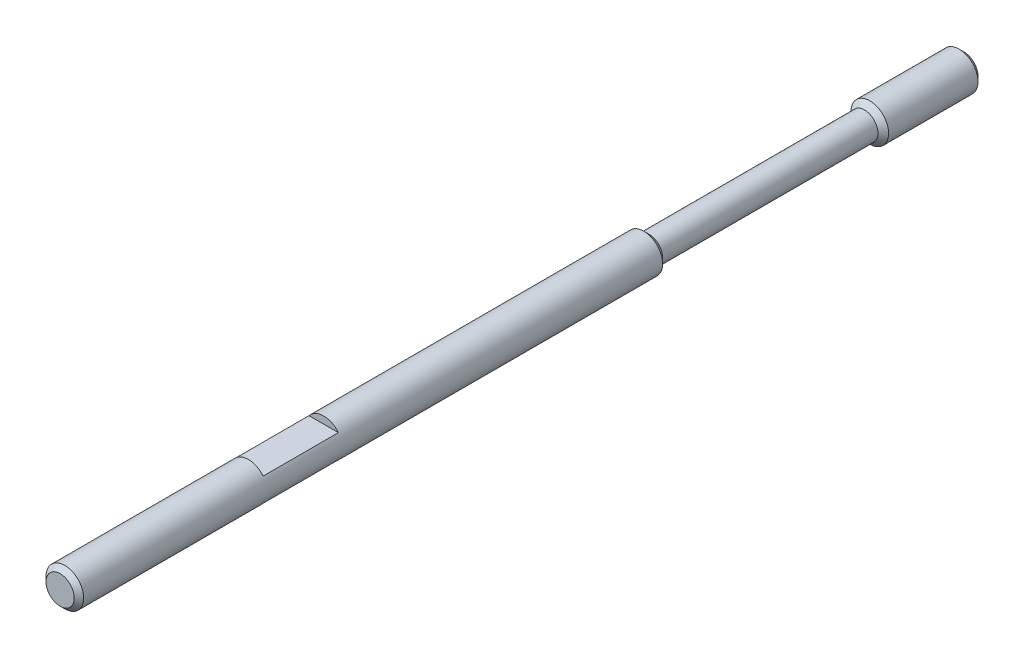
ISO-10303-21;
HEADER;
FILE_DESCRIPTION(('STEP AP214'),'2;1');
FILE_NAME('part.step','',(''),(''),'','','');
FILE_SCHEMA(('AUTOMOTIVE_DESIGN { 1 0 10303 214 1 1 1 1 }'));
ENDSEC;
DATA;
#1=APPLICATION_CONTEXT('core data for automotive mechanical design processes');
#2=APPLICATION_PROTOCOL_DEFINITION('international standard','automotive_design',2000,#1);
#3=PRODUCT_CONTEXT('',#1,'mechanical');
#4=PRODUCT('Part','Part','',(#3));
#5=PRODUCT_RELATED_PRODUCT_CATEGORY('part','',(#4));
#6=PRODUCT_DEFINITION_FORMATION('','',#4);
#7=PRODUCT_DEFINITION_CONTEXT('part definition',#1,'design');
#8=PRODUCT_DEFINITION('design','',#6,#7);
#9=PRODUCT_DEFINITION_SHAPE('','',#8);
#10=(LENGTH_UNIT() NAMED_UNIT(*) SI_UNIT(.MILLI.,.METRE.));
#11=(NAMED_UNIT(*) PLANE_ANGLE_UNIT() SI_UNIT($,.RADIAN.));
#12=(NAMED_UNIT(*) SI_UNIT($,.STERADIAN.) SOLID_ANGLE_UNIT());
#13=UNCERTAINTY_MEASURE_WITH_UNIT(LENGTH_MEASURE(1.E-05),#10,'distance_accuracy_value','');
#14=(GEOMETRIC_REPRESENTATION_CONTEXT(3) GLOBAL_UNCERTAINTY_ASSIGNED_CONTEXT((#13)) GLOBAL_UNIT_ASSIGNED_CONTEXT((#10,
#11,#12)) REPRESENTATION_CONTEXT('',''));
#15=CARTESIAN_POINT('',(0.,0.,0.));
#16=DIRECTION('',(0.,0.,1.));
#17=DIRECTION('',(1.,0.,0.));
#18=AXIS2_PLACEMENT_3D('',#15,#16,#17);
#19=CARTESIAN_POINT('',(0.,0.,0.));
#20=DIRECTION('',(0.,0.,1.));
#21=DIRECTION('',(1.,0.,0.));
#22=AXIS2_PLACEMENT_3D('',#19,#20,#21);
#23=PLANE('',#22);
#24=CARTESIAN_POINT('',(0.,0.,0.));
#25=DIRECTION('',(0.,0.,1.));
#26=DIRECTION('',(1.,0.,0.));
#27=AXIS2_PLACEMENT_3D('',#24,#25,#26);
#28=CIRCLE('',#27,2.38124999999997);
#29=CARTESIAN_POINT('',(-2.38124999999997,0.,0.));
#30=VERTEX_POINT('',#29);
#31=EDGE_CURVE('E367',#30,#30,#28,.T.);
#32=ORIENTED_EDGE('',*,*,#31,.T.);
#33=EDGE_LOOP('',(#32));
#34=FACE_BOUND('',#33,.T.);
#35=ADVANCED_FACE('F302',(#34),#23,.T.);
#36=CARTESIAN_POINT('',(0.,0.,0.));
#37=DIRECTION('',(0.,0.,-1.));
#38=DIRECTION('',(-1.,0.,0.));
#39=AXIS2_PLACEMENT_3D('',#36,#37,#38);
#40=CYLINDRICAL_SURFACE('',#39,3.175);
#41=CARTESIAN_POINT('',(0.,0.,-0.793750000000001));
#42=DIRECTION('',(0.,0.,1.));
#43=DIRECTION('',(1.,0.,0.));
#44=AXIS2_PLACEMENT_3D('',#41,#42,#43);
#45=CIRCLE('',#44,3.175);
#46=CARTESIAN_POINT('',(-3.175,0.,-0.793750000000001));
#47=VERTEX_POINT('',#46);
#48=EDGE_CURVE('E361',#47,#47,#45,.F.);
#49=ORIENTED_EDGE('',*,*,#48,.T.);
#50=EDGE_LOOP('',(#49));
#51=FACE_BOUND('',#50,.T.);
#52=CARTESIAN_POINT('',(0.,0.,-31.75));
#53=DIRECTION('',(0.,0.,1.));
#54=DIRECTION('',(1.,0.,0.));
#55=AXIS2_PLACEMENT_3D('',#52,#53,#54);
#56=CIRCLE('',#55,3.175);
#57=CARTESIAN_POINT('',(2.47848358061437,-1.984375,-31.75));
#58=VERTEX_POINT('',#57);
#59=CARTESIAN_POINT('',(-2.47848358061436,-1.984375,-31.75));
#60=VERTEX_POINT('',#59);
#61=EDGE_CURVE('E359',#58,#60,#56,.F.);
#62=ORIENTED_EDGE('',*,*,#61,.F.);
#63=DIRECTION('',(0.,0.,-1.));
#64=VECTOR('',#63,1.);
#65=CARTESIAN_POINT('',(2.47848358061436,-1.984375,0.));
#66=LINE('',#65,#64);
#67=CARTESIAN_POINT('',(2.47848358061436,-1.984375,-44.45));
#68=VERTEX_POINT('',#67);
#69=EDGE_CURVE('E352',#68,#58,#66,.F.);
#70=ORIENTED_EDGE('',*,*,#69,.F.);
#71=CARTESIAN_POINT('',(0.,0.,-44.45));
#72=DIRECTION('',(0.,0.,-1.));
#73=DIRECTION('',(-1.,0.,0.));
#74=AXIS2_PLACEMENT_3D('',#71,#72,#73);
#75=CIRCLE('',#74,3.175);
#76=CARTESIAN_POINT('',(-2.47848358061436,-1.984375,-44.45));
#77=VERTEX_POINT('',#76);
#78=EDGE_CURVE('E341',#77,#68,#75,.F.);
#79=ORIENTED_EDGE('',*,*,#78,.F.);
#80=DIRECTION('',(0.,0.,-1.));
#81=VECTOR('',#80,1.);
#82=CARTESIAN_POINT('',(-2.47848358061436,-1.984375,0.));
#83=LINE('',#82,#81);
#84=EDGE_CURVE('E346',#60,#77,#83,.T.);
#85=ORIENTED_EDGE('',*,*,#84,.F.);
#86=EDGE_LOOP('',(#62,#70,#79,#85));
#87=FACE_BOUND('',#86,.T.);
#88=DIRECTION('',(0.,0.,-1.));
#89=VECTOR('',#88,1.);
#90=CARTESIAN_POINT('',(-2.47848358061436,1.984375,0.));
#91=LINE('',#90,#89);
#92=CARTESIAN_POINT('',(-2.47848358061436,1.984375,-44.45));
#93=VERTEX_POINT('',#92);
#94=CARTESIAN_POINT('',(-2.47848358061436,1.984375,-31.75));
#95=VERTEX_POINT('',#94);
#96=EDGE_CURVE('E347',#93,#95,#91,.F.);
#97=ORIENTED_EDGE('',*,*,#96,.F.);
#98=CARTESIAN_POINT('',(0.,0.,-44.45));
#99=DIRECTION('',(0.,0.,-1.));
#100=DIRECTION('',(-1.,0.,0.));
#101=AXIS2_PLACEMENT_3D('',#98,#99,#100);
#102=CIRCLE('',#101,3.175);
#103=CARTESIAN_POINT('',(2.47848358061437,1.984375,-44.45));
#104=VERTEX_POINT('',#103);
#105=EDGE_CURVE('E450',#104,#93,#102,.F.);
#106=ORIENTED_EDGE('',*,*,#105,.F.);
#107=DIRECTION('',(0.,0.,-1.));
#108=VECTOR('',#107,1.);
#109=CARTESIAN_POINT('',(2.47848358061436,1.984375,0.));
#110=LINE('',#109,#108);
#111=CARTESIAN_POINT('',(2.47848358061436,1.984375,-31.75));
#112=VERTEX_POINT('',#111);
#113=EDGE_CURVE('E448',#112,#104,#110,.T.);
#114=ORIENTED_EDGE('',*,*,#113,.F.);
#115=CARTESIAN_POINT('',(0.,0.,-31.75));
#116=DIRECTION('',(0.,0.,1.));
#117=DIRECTION('',(1.,0.,0.));
#118=AXIS2_PLACEMENT_3D('',#115,#116,#117);
#119=CIRCLE('',#118,3.175);
#120=EDGE_CURVE('E452',#95,#112,#119,.F.);
#121=ORIENTED_EDGE('',*,*,#120,.F.);
#122=EDGE_LOOP('',(#97,#106,#114,#121));
#123=FACE_BOUND('',#122,.T.);
#124=CARTESIAN_POINT('',(0.,0.,-98.425));
#125=DIRECTION('',(0.,0.,-1.));
#126=DIRECTION('',(-1.,0.,0.));
#127=AXIS2_PLACEMENT_3D('',#124,#125,#126);
#128=CIRCLE('',#127,3.175);
#129=CARTESIAN_POINT('',(-3.175,0.,-98.425));
#130=VERTEX_POINT('',#129);
#131=EDGE_CURVE('E444',#130,#130,#128,.T.);
#132=ORIENTED_EDGE('',*,*,#131,.F.);
#133=EDGE_LOOP('',(#132));
#134=FACE_BOUND('',#133,.T.);
#135=ADVANCED_FACE('F357',(#51,#87,#123,#134),#40,.T.);
#136=CARTESIAN_POINT('',(0.,0.,-99.314));
#137=DIRECTION('',(0.,0.,1.));
#138=DIRECTION('',(1.,0.,0.));
#139=AXIS2_PLACEMENT_3D('',#136,#137,#138);
#140=CONICAL_SURFACE('',#139,2.28600000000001,0.785398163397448);
#141=ORIENTED_EDGE('',*,*,#131,.T.);
#142=EDGE_LOOP('',(#141));
#143=FACE_BOUND('',#142,.T.);
#144=CARTESIAN_POINT('',(0.,0.,-99.314));
#145=DIRECTION('',(0.,0.,-1.));
#146=DIRECTION('',(-1.,0.,0.));
#147=AXIS2_PLACEMENT_3D('',#144,#145,#146);
#148=CIRCLE('',#147,2.28600000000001);
#149=CARTESIAN_POINT('',(-2.28600000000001,0.,-99.314));
#150=VERTEX_POINT('',#149);
#151=EDGE_CURVE('E441',#150,#150,#148,.T.);
#152=ORIENTED_EDGE('',*,*,#151,.F.);
#153=EDGE_LOOP('',(#152));
#154=FACE_BOUND('',#153,.T.);
#155=ADVANCED_FACE('F388',(#143,#154),#140,.T.);
#156=CARTESIAN_POINT('',(0.,0.,0.));
#157=DIRECTION('',(0.,0.,-1.));
#158=DIRECTION('',(-1.,0.,0.));
#159=AXIS2_PLACEMENT_3D('',#156,#157,#158);
#160=CYLINDRICAL_SURFACE('',#159,2.28600000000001);
#161=ORIENTED_EDGE('',*,*,#151,.T.);
#162=EDGE_LOOP('',(#161));
#163=FACE_BOUND('',#162,.T.);
#164=CARTESIAN_POINT('',(0.,0.,-135.636));
#165=DIRECTION('',(0.,0.,-1.));
#166=DIRECTION('',(-1.,0.,0.));
#167=AXIS2_PLACEMENT_3D('',#164,#165,#166);
#168=CIRCLE('',#167,2.28600000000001);
#169=CARTESIAN_POINT('',(-2.28600000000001,0.,-135.636));
#170=VERTEX_POINT('',#169);
#171=EDGE_CURVE('E438',#170,#170,#168,.T.);
#172=ORIENTED_EDGE('',*,*,#171,.F.);
#173=EDGE_LOOP('',(#172));
#174=FACE_BOUND('',#173,.T.);
#175=ADVANCED_FACE('F394',(#163,#174),#160,.T.);
#176=CARTESIAN_POINT('',(0.,0.,-136.525));
#177=DIRECTION('',(0.,0.,-1.));
#178=DIRECTION('',(-1.,0.,0.));
#179=AXIS2_PLACEMENT_3D('',#176,#177,#178);
#180=CONICAL_SURFACE('',#179,3.175,0.78539816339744);
#181=ORIENTED_EDGE('',*,*,#171,.T.);
#182=EDGE_LOOP('',(#181));
#183=FACE_BOUND('',#182,.T.);
#184=CARTESIAN_POINT('',(0.,0.,-136.525));
#185=DIRECTION('',(0.,0.,-1.));
#186=DIRECTION('',(-1.,0.,0.));
#187=AXIS2_PLACEMENT_3D('',#184,#185,#186);
#188=CIRCLE('',#187,3.175);
#189=CARTESIAN_POINT('',(-3.175,0.,-136.525));
#190=VERTEX_POINT('',#189);
#191=EDGE_CURVE('E434',#190,#190,#188,.T.);
#192=ORIENTED_EDGE('',*,*,#191,.F.);
#193=EDGE_LOOP('',(#192));
#194=FACE_BOUND('',#193,.T.);
#195=ADVANCED_FACE('F398',(#183,#194),#180,.T.);
#196=CARTESIAN_POINT('',(0.,0.,0.));
#197=DIRECTION('',(0.,0.,-1.));
#198=DIRECTION('',(-1.,0.,0.));
#199=AXIS2_PLACEMENT_3D('',#196,#197,#198);
#200=CYLINDRICAL_SURFACE('',#199,3.175);
#201=CARTESIAN_POINT('',(0.,0.,-151.60625));
#202=DIRECTION('',(0.,0.,-1.));
#203=DIRECTION('',(-1.,0.,0.));
#204=AXIS2_PLACEMENT_3D('',#201,#202,#203);
#205=CIRCLE('',#204,3.175);
#206=CARTESIAN_POINT('',(-3.175,0.,-151.60625));
#207=VERTEX_POINT('',#206);
#208=EDGE_CURVE('E12',#207,#207,#205,.F.);
#209=ORIENTED_EDGE('',*,*,#208,.T.);
#210=EDGE_LOOP('',(#209));
#211=FACE_BOUND('',#210,.T.);
#212=ORIENTED_EDGE('',*,*,#191,.T.);
#213=EDGE_LOOP('',(#212));
#214=FACE_BOUND('',#213,.T.);
#215=ADVANCED_FACE('F402',(#211,#214),#200,.T.);
#216=CARTESIAN_POINT('',(0.,3.175,-152.4));
#217=DIRECTION('',(0.,0.,-1.));
#218=DIRECTION('',(-1.,0.,0.));
#219=AXIS2_PLACEMENT_3D('',#216,#217,#218);
#220=PLANE('',#219);
#221=CARTESIAN_POINT('',(0.,0.,-152.4));
#222=DIRECTION('',(0.,0.,-1.));
#223=DIRECTION('',(-1.,0.,0.));
#224=AXIS2_PLACEMENT_3D('',#221,#222,#223);
#225=CIRCLE('',#224,2.38125000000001);
#226=CARTESIAN_POINT('',(-2.38125000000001,0.,-152.4));
#227=VERTEX_POINT('',#226);
#228=EDGE_CURVE('E310',#227,#227,#225,.T.);
#229=ORIENTED_EDGE('',*,*,#228,.T.);
#230=EDGE_LOOP('',(#229));
#231=FACE_BOUND('',#230,.T.);
#232=ADVANCED_FACE('F372',(#231),#220,.T.);
#233=CARTESIAN_POINT('',(-7.9375,7.03183248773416,-31.75));
#234=DIRECTION('',(0.,0.,1.));
#235=DIRECTION('',(1.,0.,0.));
#236=AXIS2_PLACEMENT_3D('',#233,#234,#235);
#237=PLANE('',#236);
#238=ORIENTED_EDGE('',*,*,#120,.T.);
#239=DIRECTION('',(1.,0.,0.));
#240=VECTOR('',#239,1.);
#241=CARTESIAN_POINT('',(-7.9375,1.984375,-31.75));
#242=LINE('',#241,#240);
#243=EDGE_CURVE('E324',#95,#112,#242,.T.);
#244=ORIENTED_EDGE('',*,*,#243,.F.);
#245=EDGE_LOOP('',(#238,#244));
#246=FACE_BOUND('',#245,.T.);
#247=ADVANCED_FACE('F409',(#246),#237,.F.);
#248=CARTESIAN_POINT('',(-7.9375,7.03183248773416,-44.45));
#249=DIRECTION('',(0.,0.,-1.));
#250=DIRECTION('',(-1.,0.,0.));
#251=AXIS2_PLACEMENT_3D('',#248,#249,#250);
#252=PLANE('',#251);
#253=ORIENTED_EDGE('',*,*,#105,.T.);
#254=DIRECTION('',(1.,0.,0.));
#255=VECTOR('',#254,1.);
#256=CARTESIAN_POINT('',(-7.9375,1.984375,-44.45));
#257=LINE('',#256,#255);
#258=EDGE_CURVE('E430',#93,#104,#257,.T.);
#259=ORIENTED_EDGE('',*,*,#258,.T.);
#260=EDGE_LOOP('',(#253,#259));
#261=FACE_BOUND('',#260,.T.);
#262=ADVANCED_FACE('F412',(#261),#252,.F.);
#263=CARTESIAN_POINT('',(-7.9375,1.984375,-31.75));
#264=DIRECTION('',(0.,-1.,0.));
#265=DIRECTION('',(0.,0.,-1.));
#266=AXIS2_PLACEMENT_3D('',#263,#264,#265);
#267=PLANE('',#266);
#268=ORIENTED_EDGE('',*,*,#96,.T.);
#269=ORIENTED_EDGE('',*,*,#243,.T.);
#270=ORIENTED_EDGE('',*,*,#113,.T.);
#271=ORIENTED_EDGE('',*,*,#258,.F.);
#272=EDGE_LOOP('',(#268,#269,#270,#271));
#273=FACE_BOUND('',#272,.T.);
#274=ADVANCED_FACE('F414',(#273),#267,.F.);
#275=CARTESIAN_POINT('',(-7.9375,-7.03183248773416,-31.75));
#276=DIRECTION('',(0.,0.,1.));
#277=DIRECTION('',(1.,0.,0.));
#278=AXIS2_PLACEMENT_3D('',#275,#276,#277);
#279=PLANE('',#278);
#280=ORIENTED_EDGE('',*,*,#61,.T.);
#281=DIRECTION('',(1.,0.,0.));
#282=VECTOR('',#281,1.);
#283=CARTESIAN_POINT('',(-7.9375,-1.984375,-31.75));
#284=LINE('',#283,#282);
#285=EDGE_CURVE('E354',#60,#58,#284,.T.);
#286=ORIENTED_EDGE('',*,*,#285,.T.);
#287=EDGE_LOOP('',(#280,#286));
#288=FACE_BOUND('',#287,.T.);
#289=ADVANCED_FACE('F417',(#288),#279,.F.);
#290=CARTESIAN_POINT('',(-7.9375,-1.984375,-31.75));
#291=DIRECTION('',(0.,1.,0.));
#292=DIRECTION('',(0.,0.,1.));
#293=AXIS2_PLACEMENT_3D('',#290,#291,#292);
#294=PLANE('',#293);
#295=ORIENTED_EDGE('',*,*,#69,.T.);
#296=ORIENTED_EDGE('',*,*,#285,.F.);
#297=ORIENTED_EDGE('',*,*,#84,.T.);
#298=DIRECTION('',(1.,0.,0.));
#299=VECTOR('',#298,1.);
#300=CARTESIAN_POINT('',(-7.9375,-1.984375,-44.45));
#301=LINE('',#300,#299);
#302=EDGE_CURVE('E316',#77,#68,#301,.T.);
#303=ORIENTED_EDGE('',*,*,#302,.T.);
#304=EDGE_LOOP('',(#295,#296,#297,#303));
#305=FACE_BOUND('',#304,.T.);
#306=ADVANCED_FACE('F350',(#305),#294,.F.);
#307=CARTESIAN_POINT('',(-7.9375,-7.03183248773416,-44.45));
#308=DIRECTION('',(0.,0.,-1.));
#309=DIRECTION('',(-1.,0.,0.));
#310=AXIS2_PLACEMENT_3D('',#307,#308,#309);
#311=PLANE('',#310);
#312=ORIENTED_EDGE('',*,*,#78,.T.);
#313=ORIENTED_EDGE('',*,*,#302,.F.);
#314=EDGE_LOOP('',(#312,#313));
#315=FACE_BOUND('',#314,.T.);
#316=ADVANCED_FACE('F342',(#315),#311,.F.);
#317=CARTESIAN_POINT('',(0.,0.,-0.793750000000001));
#318=DIRECTION('',(0.,0.,-1.));
#319=DIRECTION('',(-1.,0.,0.));
#320=AXIS2_PLACEMENT_3D('',#317,#318,#319);
#321=CONICAL_SURFACE('',#320,3.175,0.785398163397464);
#322=CARTESIAN_POINT('',(-2.38124999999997,0.,0.));
#323=CARTESIAN_POINT('',(-2.38951822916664,0.,-0.00826822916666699));
#324=CARTESIAN_POINT('',(-2.39778645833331,0.,-0.0165364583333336));
#325=CARTESIAN_POINT('',(-2.41432291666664,0.,-0.0330729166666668));
#326=CARTESIAN_POINT('',(-2.42259114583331,0.,-0.0413411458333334));
#327=CARTESIAN_POINT('',(-2.43912760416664,0.,-0.0578776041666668));
#328=CARTESIAN_POINT('',(-2.44739583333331,0.,-0.0661458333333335));
#329=CARTESIAN_POINT('',(-2.46393229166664,0.,-0.0826822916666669));
#330=CARTESIAN_POINT('',(-2.47220052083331,0.,-0.0909505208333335));
#331=CARTESIAN_POINT('',(-2.48873697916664,0.,-0.107486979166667));
#332=CARTESIAN_POINT('',(-2.49700520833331,0.,-0.115755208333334));
#333=CARTESIAN_POINT('',(-2.51354166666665,0.,-0.132291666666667));
#334=CARTESIAN_POINT('',(-2.52180989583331,0.,-0.140559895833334));
#335=CARTESIAN_POINT('',(-2.53834635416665,0.,-0.157096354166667));
#336=CARTESIAN_POINT('',(-2.54661458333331,0.,-0.165364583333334));
#337=CARTESIAN_POINT('',(-2.56315104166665,0.,-0.181901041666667));
#338=CARTESIAN_POINT('',(-2.57141927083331,0.,-0.190169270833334));
#339=CARTESIAN_POINT('',(-2.58795572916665,0.,-0.206705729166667));
#340=CARTESIAN_POINT('',(-2.59622395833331,0.,-0.214973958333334));
#341=CARTESIAN_POINT('',(-2.61276041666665,0.,-0.231510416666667));
#342=CARTESIAN_POINT('',(-2.62102864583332,0.,-0.239778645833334));
#343=CARTESIAN_POINT('',(-2.63756510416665,0.,-0.256315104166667));
#344=CARTESIAN_POINT('',(-2.64583333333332,0.,-0.264583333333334));
#345=CARTESIAN_POINT('',(-2.66236979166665,0.,-0.281119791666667));
#346=CARTESIAN_POINT('',(-2.67063802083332,0.,-0.289388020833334));
#347=CARTESIAN_POINT('',(-2.68717447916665,0.,-0.305924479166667));
#348=CARTESIAN_POINT('',(-2.69544270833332,0.,-0.314192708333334));
#349=CARTESIAN_POINT('',(-2.71197916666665,0.,-0.330729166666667));
#350=CARTESIAN_POINT('',(-2.72024739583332,0.,-0.338997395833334));
#351=CARTESIAN_POINT('',(-2.73678385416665,0.,-0.355533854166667));
#352=CARTESIAN_POINT('',(-2.74505208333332,0.,-0.363802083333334));
#353=CARTESIAN_POINT('',(-2.76158854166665,0.,-0.380338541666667));
#354=CARTESIAN_POINT('',(-2.76985677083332,0.,-0.388606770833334));
#355=CARTESIAN_POINT('',(-2.78639322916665,0.,-0.405143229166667));
#356=CARTESIAN_POINT('',(-2.79466145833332,0.,-0.413411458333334));
#357=CARTESIAN_POINT('',(-2.81119791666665,0.,-0.429947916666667));
#358=CARTESIAN_POINT('',(-2.81946614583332,0.,-0.438216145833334));
#359=CARTESIAN_POINT('',(-2.83600260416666,0.,-0.454752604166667));
#360=CARTESIAN_POINT('',(-2.84427083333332,0.,-0.463020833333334));
#361=CARTESIAN_POINT('',(-2.86080729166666,0.,-0.479557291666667));
#362=CARTESIAN_POINT('',(-2.86907552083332,0.,-0.487825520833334));
#363=CARTESIAN_POINT('',(-2.88561197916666,0.,-0.504361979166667));
#364=CARTESIAN_POINT('',(-2.89388020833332,0.,-0.512630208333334));
#365=CARTESIAN_POINT('',(-2.91041666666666,0.,-0.529166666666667));
#366=CARTESIAN_POINT('',(-2.91868489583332,0.,-0.537434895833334));
#367=CARTESIAN_POINT('',(-2.93522135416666,0.,-0.553971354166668));
#368=CARTESIAN_POINT('',(-2.94348958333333,0.,-0.562239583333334));
#369=CARTESIAN_POINT('',(-2.96002604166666,0.,-0.578776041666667));
#370=CARTESIAN_POINT('',(-2.96829427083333,0.,-0.587044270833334));
#371=CARTESIAN_POINT('',(-2.98483072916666,0.,-0.603580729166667));
#372=CARTESIAN_POINT('',(-2.99309895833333,0.,-0.611848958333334));
#373=CARTESIAN_POINT('',(-3.00963541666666,0.,-0.628385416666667));
#374=CARTESIAN_POINT('',(-3.01790364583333,0.,-0.636653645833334));
#375=CARTESIAN_POINT('',(-3.03444010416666,0.,-0.653190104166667));
#376=CARTESIAN_POINT('',(-3.04270833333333,0.,-0.661458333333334));
#377=CARTESIAN_POINT('',(-3.05924479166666,0.,-0.677994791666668));
#378=CARTESIAN_POINT('',(-3.06751302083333,0.,-0.686263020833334));
#379=CARTESIAN_POINT('',(-3.08404947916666,0.,-0.702799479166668));
#380=CARTESIAN_POINT('',(-3.09231770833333,0.,-0.711067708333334));
#381=CARTESIAN_POINT('',(-3.10885416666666,0.,-0.727604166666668));
#382=CARTESIAN_POINT('',(-3.11712239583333,0.,-0.735872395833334));
#383=CARTESIAN_POINT('',(-3.13365885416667,0.,-0.752408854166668));
#384=CARTESIAN_POINT('',(-3.14192708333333,0.,-0.760677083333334));
#385=CARTESIAN_POINT('',(-3.15846354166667,0.,-0.777213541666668));
#386=CARTESIAN_POINT('',(-3.16673177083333,0.,-0.785481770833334));
#387=CARTESIAN_POINT('',(-3.175,0.,-0.793750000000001));
#388=B_SPLINE_CURVE_WITH_KNOTS('',3,(#322,#323,#324,#325,#326,#327,#328,#329,#330,#331,#332,
#333,#334,#335,#336,#337,#338,#339,#340,#341,#342,#343,#344,#345,#346,#347,#348,#349,#350,#351,
#352,#353,#354,#355,#356,#357,#358,#359,#360,#361,#362,#363,#364,#365,#366,#367,#368,#369,#370,
#371,#372,#373,#374,#375,#376,#377,#378,#379,#380,#381,#382,#383,#384,#385,#386,#387),
.UNSPECIFIED.,.F.,.F.,(4,2,2,2,2,2,2,2,2,2,2,2,2,2,2,2,2,2,2,2,2,2,2,2,2,2,2,2,2,2,2,2,4),(0.,
0.035079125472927,0.0701582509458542,0.105237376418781,0.140316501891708,0.175395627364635,
0.210474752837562,0.245553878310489,0.280633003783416,0.315712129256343,0.35079125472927,
0.385870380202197,0.420949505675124,0.456028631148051,0.491107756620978,0.526186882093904,
0.561266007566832,0.596345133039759,0.631424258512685,0.666503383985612,0.701582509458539,
0.736661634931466,0.771740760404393,0.80681988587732,0.841899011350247,0.876978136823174,
0.912057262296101,0.947136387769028,0.982215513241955,1.01729463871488,1.05237376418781,
1.08745288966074,1.12253201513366),.UNSPECIFIED.);
#389=EDGE_CURVE('BSEAM375',#30,#47,#388,.T.);
#390=ORIENTED_EDGE('',*,*,#31,.F.);
#391=ORIENTED_EDGE('',*,*,#48,.F.);
#392=ORIENTED_EDGE('',*,*,#389,.T.);
#393=ORIENTED_EDGE('',*,*,#389,.F.);
#394=EDGE_LOOP('',(#390,#392,#391,#393));
#395=FACE_BOUND('',#394,.T.);
#396=ADVANCED_FACE('F375',(#395),#321,.T.);
#397=CARTESIAN_POINT('',(0.,0.,-152.4));
#398=DIRECTION('',(0.,0.,1.));
#399=DIRECTION('',(1.,0.,0.));
#400=AXIS2_PLACEMENT_3D('',#397,#398,#399);
#401=CONICAL_SURFACE('',#400,2.38125000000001,0.78539816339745);
#402=ORIENTED_EDGE('',*,*,#208,.F.);
#403=EDGE_LOOP('',(#402));
#404=FACE_BOUND('',#403,.T.);
#405=ORIENTED_EDGE('',*,*,#228,.F.);
#406=EDGE_LOOP('',(#405));
#407=FACE_BOUND('',#406,.T.);
#408=ADVANCED_FACE('F304',(#404,#407),#401,.T.);
#409=CLOSED_SHELL('',(#35,#135,#155,#175,#195,#215,#232,#247,#262,#274,#289,#306,#316,#396,#408));
#410=MANIFOLD_SOLID_BREP('B2',#409);
#411=ADVANCED_BREP_SHAPE_REPRESENTATION('',(#18,#410),#14);
#412=SHAPE_DEFINITION_REPRESENTATION(#9,#411);
ENDSEC;
END-ISO-10303-21;
